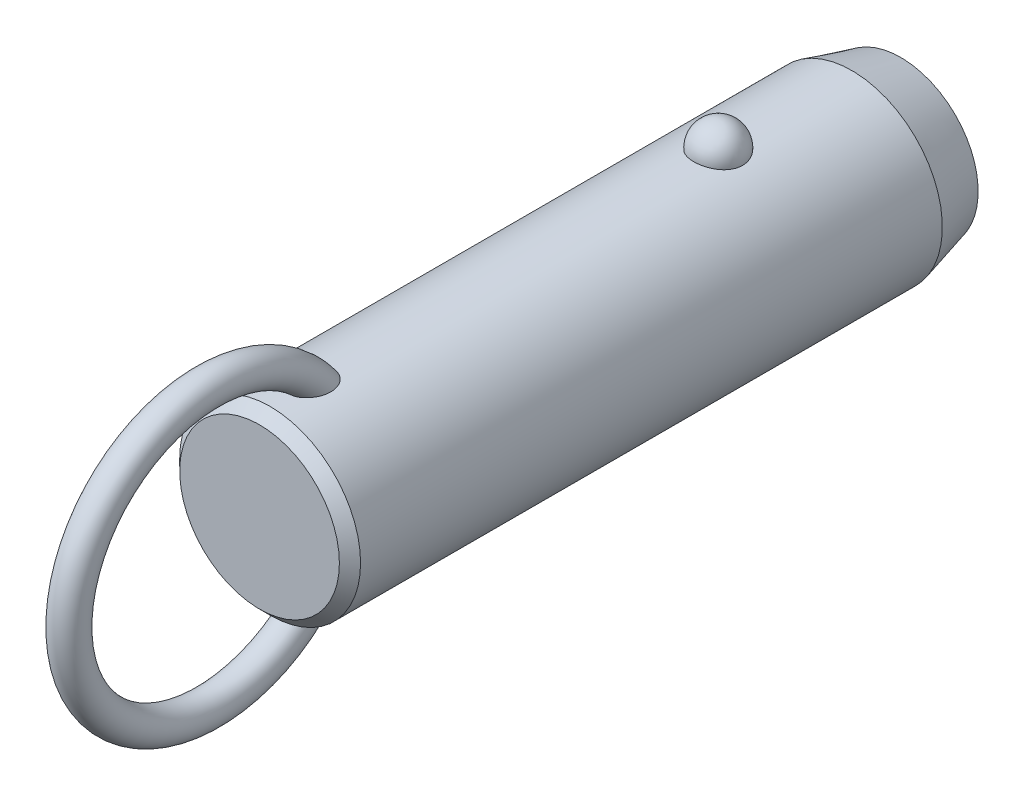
ISO-10303-21;
HEADER;
FILE_DESCRIPTION(('STEP AP214'),'2;1');
FILE_NAME('part.step','',(''),(''),'','','');
FILE_SCHEMA(('AUTOMOTIVE_DESIGN { 1 0 10303 214 1 1 1 1 }'));
ENDSEC;
DATA;
#1=APPLICATION_CONTEXT('core data for automotive mechanical design processes');
#2=APPLICATION_PROTOCOL_DEFINITION('international standard','automotive_design',2000,#1);
#3=PRODUCT_CONTEXT('',#1,'mechanical');
#4=PRODUCT('Part','Part','',(#3));
#5=PRODUCT_RELATED_PRODUCT_CATEGORY('part','',(#4));
#6=PRODUCT_DEFINITION_FORMATION('','',#4);
#7=PRODUCT_DEFINITION_CONTEXT('part definition',#1,'design');
#8=PRODUCT_DEFINITION('design','',#6,#7);
#9=PRODUCT_DEFINITION_SHAPE('','',#8);
#10=(LENGTH_UNIT() NAMED_UNIT(*) SI_UNIT(.MILLI.,.METRE.));
#11=(NAMED_UNIT(*) PLANE_ANGLE_UNIT() SI_UNIT($,.RADIAN.));
#12=(NAMED_UNIT(*) SI_UNIT($,.STERADIAN.) SOLID_ANGLE_UNIT());
#13=UNCERTAINTY_MEASURE_WITH_UNIT(LENGTH_MEASURE(1.E-05),#10,'distance_accuracy_value','');
#14=(GEOMETRIC_REPRESENTATION_CONTEXT(3) GLOBAL_UNCERTAINTY_ASSIGNED_CONTEXT((#13)) GLOBAL_UNIT_ASSIGNED_CONTEXT((#10,
#11,#12)) REPRESENTATION_CONTEXT('',''));
#15=CARTESIAN_POINT('',(0.,0.,0.));
#16=DIRECTION('',(0.,0.,1.));
#17=DIRECTION('',(1.,0.,0.));
#18=AXIS2_PLACEMENT_3D('',#15,#16,#17);
#19=CARTESIAN_POINT('',(0.,0.,40.6));
#20=DIRECTION('',(0.,0.,-1.));
#21=DIRECTION('',(-1.,0.,0.));
#22=AXIS2_PLACEMENT_3D('',#19,#20,#21);
#23=CYLINDRICAL_SURFACE('',#22,11.1);
#24=CARTESIAN_POINT('',(2.9724815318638,10.6945945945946,-3.));
#25=CARTESIAN_POINT('',(2.97247830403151,10.6945972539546,-2.83225059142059));
#26=CARTESIAN_POINT('',(2.95876598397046,10.6984356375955,-2.6644597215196));
#27=CARTESIAN_POINT('',(2.90424529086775,10.7133624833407,-2.33362381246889));
#28=CARTESIAN_POINT('',(2.8634252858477,10.7244540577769,-2.1705808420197));
#29=CARTESIAN_POINT('',(2.75573657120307,10.7526272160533,-1.85396767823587));
#30=CARTESIAN_POINT('',(2.68887937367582,10.7697061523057,-1.70039333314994));
#31=CARTESIAN_POINT('',(2.53079696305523,10.8079438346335,-1.40691598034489));
#32=CARTESIAN_POINT('',(2.43957264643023,10.8291024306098,-1.2670124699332));
#33=CARTESIAN_POINT('',(2.23458150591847,10.8732541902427,-1.00409565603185));
#34=CARTESIAN_POINT('',(2.12071295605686,10.8962553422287,-0.881162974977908));
#35=CARTESIAN_POINT('',(1.87365402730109,10.9414421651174,-0.656352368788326));
#36=CARTESIAN_POINT('',(1.74046358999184,10.9636278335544,-0.554474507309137));
#37=CARTESIAN_POINT('',(1.45872188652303,11.0046495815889,-0.374872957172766));
#38=CARTESIAN_POINT('',(1.31021276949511,11.0234944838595,-0.297085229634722));
#39=CARTESIAN_POINT('',(1.00170030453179,11.0557957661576,-0.167529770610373));
#40=CARTESIAN_POINT('',(0.841698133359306,11.0692526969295,-0.115759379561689));
#41=CARTESIAN_POINT('',(0.517607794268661,11.0890932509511,-0.0403925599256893));
#42=CARTESIAN_POINT('',(0.353633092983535,11.0955916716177,-0.0163383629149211));
#43=CARTESIAN_POINT('',(0.0238420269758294,11.1011989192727,0.00445177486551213));
#44=CARTESIAN_POINT('',(-0.141974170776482,11.1003084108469,0.0011901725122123));
#45=CARTESIAN_POINT('',(-0.468405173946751,11.0912990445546,-0.0323233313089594));
#46=CARTESIAN_POINT('',(-0.629059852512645,11.0832767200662,-0.0622147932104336));
#47=CARTESIAN_POINT('',(-0.942937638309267,11.0609962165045,-0.147645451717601));
#48=CARTESIAN_POINT('',(-1.09616062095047,11.0467379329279,-0.203185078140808));
#49=CARTESIAN_POINT('',(-1.39181061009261,11.0134071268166,-0.338752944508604));
#50=CARTESIAN_POINT('',(-1.53417383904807,10.9943086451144,-0.418913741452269));
#51=CARTESIAN_POINT('',(-1.80342160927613,10.9533667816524,-0.601448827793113));
#52=CARTESIAN_POINT('',(-1.9303046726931,10.9315231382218,-0.703825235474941));
#53=CARTESIAN_POINT('',(-2.16747598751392,10.887005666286,-0.930091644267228));
#54=CARTESIAN_POINT('',(-2.27742774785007,10.8643239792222,-1.05433291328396));
#55=CARTESIAN_POINT('',(-2.47517316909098,10.8209886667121,-1.31966633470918));
#56=CARTESIAN_POINT('',(-2.56296538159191,10.8003351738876,-1.46075958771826));
#57=CARTESIAN_POINT('',(-2.71500300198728,10.7631304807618,-1.75753646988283));
#58=CARTESIAN_POINT('',(-2.77898901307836,10.7466250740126,-1.91335887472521));
#59=CARTESIAN_POINT('',(-2.88046189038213,10.7198747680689,-2.2339152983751));
#60=CARTESIAN_POINT('',(-2.91794947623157,10.709629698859,-2.39864907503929));
#61=CARTESIAN_POINT('',(-2.96537819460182,10.6965949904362,-2.73165170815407));
#62=CARTESIAN_POINT('',(-2.97542891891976,10.693775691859,-2.89990378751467));
#63=CARTESIAN_POINT('',(-2.96804271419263,10.6958279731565,-3.23575286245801));
#64=CARTESIAN_POINT('',(-2.95060646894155,10.7006993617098,-3.40334987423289));
#65=CARTESIAN_POINT('',(-2.88883358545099,10.71753912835,-3.73233906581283));
#66=CARTESIAN_POINT('',(-2.84462026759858,10.7294749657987,-3.89375610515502));
#67=CARTESIAN_POINT('',(-2.73050447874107,10.7590797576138,-4.20667949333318));
#68=CARTESIAN_POINT('',(-2.66060103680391,10.7767489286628,-4.35818546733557));
#69=CARTESIAN_POINT('',(-2.49642559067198,10.8159599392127,-4.6478542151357));
#70=CARTESIAN_POINT('',(-2.40203047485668,10.8375211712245,-4.78594458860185));
#71=CARTESIAN_POINT('',(-2.19143488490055,10.8820570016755,-5.04410382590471));
#72=CARTESIAN_POINT('',(-2.07523364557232,10.9050316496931,-5.16417205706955));
#73=CARTESIAN_POINT('',(-1.82361254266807,10.9499219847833,-5.38334833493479));
#74=CARTESIAN_POINT('',(-1.68812945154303,10.9718338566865,-5.48238464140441));
#75=CARTESIAN_POINT('',(-1.40191298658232,11.0120611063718,-5.6561887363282));
#76=CARTESIAN_POINT('',(-1.25118062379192,11.0303767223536,-5.73095813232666));
#77=CARTESIAN_POINT('',(-0.940570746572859,11.0611653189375,-5.85334725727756));
#78=CARTESIAN_POINT('',(-0.780821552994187,11.0737044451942,-5.901275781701));
#79=CARTESIAN_POINT('',(-0.455204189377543,11.0918598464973,-5.9699297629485));
#80=CARTESIAN_POINT('',(-0.289336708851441,11.0974768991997,-5.99065827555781));
#81=CARTESIAN_POINT('',(0.0406846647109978,11.1011307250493,-6.00418773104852));
#82=CARTESIAN_POINT('',(0.204817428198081,11.099299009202,-5.99747318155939));
#83=CARTESIAN_POINT('',(0.5295530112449,11.088551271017,-5.95740317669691));
#84=CARTESIAN_POINT('',(0.69015594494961,11.0796354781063,-5.92404858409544));
#85=CARTESIAN_POINT('',(1.0027760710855,11.0557204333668,-5.83180084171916));
#86=CARTESIAN_POINT('',(1.15482001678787,11.0407414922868,-5.77299291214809));
#87=CARTESIAN_POINT('',(1.44678373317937,11.0062913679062,-5.63147366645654));
#88=CARTESIAN_POINT('',(1.58670279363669,10.9868199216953,-5.54876095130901));
#89=CARTESIAN_POINT('',(1.8527023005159,10.9451315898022,-5.36027644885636));
#90=CARTESIAN_POINT('',(1.97855158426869,10.9228788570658,-5.25418644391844));
#91=CARTESIAN_POINT('',(2.21080872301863,10.8782509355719,-5.02251354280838));
#92=CARTESIAN_POINT('',(2.31721312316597,10.8558757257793,-4.89692718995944));
#93=CARTESIAN_POINT('',(2.5094551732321,10.8130715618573,-4.62745408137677));
#94=CARTESIAN_POINT('',(2.59493284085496,10.7926798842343,-4.48330448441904));
#95=CARTESIAN_POINT('',(2.740862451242,10.7565495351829,-4.18236358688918));
#96=CARTESIAN_POINT('',(2.80132490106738,10.7408089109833,-4.02557762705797));
#97=CARTESIAN_POINT('',(2.88959070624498,10.7173718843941,-3.72475308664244));
#98=CARTESIAN_POINT('',(2.92062102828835,10.7088950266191,-3.58171216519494));
#99=CARTESIAN_POINT('',(2.96206765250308,10.6975052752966,-3.29245795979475));
#100=CARTESIAN_POINT('',(2.97248434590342,10.6945922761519,-3.14624473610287));
#101=CARTESIAN_POINT('',(2.9724815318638,10.6945945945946,-3.));
#102=B_SPLINE_CURVE_WITH_KNOTS('',3,(#24,#25,#26,#27,#28,#29,#30,#31,#32,#33,#34,#35,#36,#37,
#38,#39,#40,#41,#42,#43,#44,#45,#46,#47,#48,#49,#50,#51,#52,#53,#54,#55,#56,#57,#58,#59,#60,#61,
#62,#63,#64,#65,#66,#67,#68,#69,#70,#71,#72,#73,#74,#75,#76,#77,#78,#79,#80,#81,#82,#83,#84,#85,
#86,#87,#88,#89,#90,#91,#92,#93,#94,#95,#96,#97,#98,#99,#100,#101),.UNSPECIFIED.,.T.,.F.,(4,2,2,
2,2,2,2,2,2,2,2,2,2,2,2,2,2,2,2,2,2,2,2,2,2,2,2,2,2,2,2,2,2,2,2,2,2,2,4),(0.,0.502722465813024,
1.00566079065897,1.5083769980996,2.01107471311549,2.51608392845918,3.02109467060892,
3.52475118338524,4.02835620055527,4.523518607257,5.0186364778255,5.50715297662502,
5.9956776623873,6.48688002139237,6.97812923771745,7.47814366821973,7.9781907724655,
8.48353712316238,8.9888697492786,9.49218093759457,9.99547960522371,10.4964777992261,
10.997494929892,11.5010810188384,12.0046847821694,12.5099796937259,13.0152411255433,
13.5145635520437,14.0138298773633,14.5043200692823,14.9947943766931,15.4836390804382,
15.9725123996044,16.4685040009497,16.9645836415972,17.4686765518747,17.972557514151,
18.410841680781,18.849117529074),.UNSPECIFIED.);
#103=CARTESIAN_POINT('',(2.9724815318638,10.6945945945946,-3.));
#104=VERTEX_POINT('',#103);
#105=EDGE_CURVE('E41',#104,#104,#102,.T.);
#106=ORIENTED_EDGE('',*,*,#105,.T.);
#107=EDGE_LOOP('',(#106));
#108=FACE_BOUND('',#107,.T.);
#109=CARTESIAN_POINT('',(0.,0.,52.));
#110=DIRECTION('',(0.,0.,1.));
#111=DIRECTION('',(1.,0.,0.));
#112=AXIS2_PLACEMENT_3D('',#109,#110,#111);
#113=CIRCLE('',#112,11.1);
#114=CARTESIAN_POINT('',(11.1,0.,52.));
#115=VERTEX_POINT('',#114);
#116=EDGE_CURVE('E10',#115,#115,#113,.F.);
#117=ORIENTED_EDGE('',*,*,#116,.T.);
#118=EDGE_LOOP('',(#117));
#119=FACE_BOUND('',#118,.T.);
#120=CARTESIAN_POINT('',(-0.564520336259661,-11.0856356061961,44.2578154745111));
#121=CARTESIAN_POINT('',(-0.667202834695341,-11.0804062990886,44.2912839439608));
#122=CARTESIAN_POINT('',(-0.766875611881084,-11.0738877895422,44.3338357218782));
#123=CARTESIAN_POINT('',(-0.957284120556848,-11.0590576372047,44.4354190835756));
#124=CARTESIAN_POINT('',(-1.04801616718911,-11.0507452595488,44.4944574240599));
#125=CARTESIAN_POINT('',(-1.21800952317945,-11.0333016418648,44.6265293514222));
#126=CARTESIAN_POINT('',(-1.29730805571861,-11.0241732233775,44.6995156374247));
#127=CARTESIAN_POINT('',(-1.44337665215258,-11.0060026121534,44.8570374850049));
#128=CARTESIAN_POINT('',(-1.51014622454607,-10.9969604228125,44.9415734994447));
#129=CARTESIAN_POINT('',(-1.63454620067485,-10.9791841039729,45.1255213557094));
#130=CARTESIAN_POINT('',(-1.69127003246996,-10.9705107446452,45.2255493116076));
#131=CARTESIAN_POINT('',(-1.78980785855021,-10.9548648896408,45.4327902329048));
#132=CARTESIAN_POINT('',(-1.83161214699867,-10.9478935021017,45.5400078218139));
#133=CARTESIAN_POINT('',(-1.91557028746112,-10.9335803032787,45.8054080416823));
#134=CARTESIAN_POINT('',(-1.95040620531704,-10.9273269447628,45.9659806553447));
#135=CARTESIAN_POINT('',(-1.99388326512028,-10.9194709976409,46.2906977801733));
#136=CARTESIAN_POINT('',(-2.00248051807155,-10.9178762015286,46.4548478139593));
#137=CARTESIAN_POINT('',(-1.99551615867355,-10.9191578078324,46.8246504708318));
#138=CARTESIAN_POINT('',(-1.9732206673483,-10.9232807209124,47.0301911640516));
#139=CARTESIAN_POINT('',(-1.9152976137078,-10.9335244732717,47.333595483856));
#140=CARTESIAN_POINT('',(-1.89184575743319,-10.9376266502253,47.4340883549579));
#141=CARTESIAN_POINT('',(-1.83700674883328,-10.9469720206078,47.632855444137));
#142=CARTESIAN_POINT('',(-1.80562070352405,-10.9522150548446,47.7311299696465));
#143=CARTESIAN_POINT('',(-1.73463055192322,-10.9636837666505,47.9259148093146));
#144=CARTESIAN_POINT('',(-1.69493416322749,-10.9699202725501,48.0223907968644));
#145=CARTESIAN_POINT('',(-1.60745141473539,-10.9830806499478,48.2116262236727));
#146=CARTESIAN_POINT('',(-1.55966150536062,-10.9900048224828,48.3043840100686));
#147=CARTESIAN_POINT('',(-1.45591812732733,-11.0042280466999,48.4846907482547));
#148=CARTESIAN_POINT('',(-1.40000013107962,-11.0115253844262,48.5722601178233));
#149=CARTESIAN_POINT('',(-1.27937470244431,-11.0261911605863,48.741029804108));
#150=CARTESIAN_POINT('',(-1.21467835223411,-11.0335594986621,48.8222379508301));
#151=CARTESIAN_POINT('',(-1.08218150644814,-11.0473027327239,48.9690010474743));
#152=CARTESIAN_POINT('',(-1.01522633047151,-11.0537063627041,49.0353092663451));
#153=CARTESIAN_POINT('',(-0.872952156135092,-11.065850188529,49.1583780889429));
#154=CARTESIAN_POINT('',(-0.797642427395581,-11.0715911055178,49.2151491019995));
#155=CARTESIAN_POINT('',(-0.651396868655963,-11.081071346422,49.3075155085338));
#156=CARTESIAN_POINT('',(-0.581712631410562,-11.0849841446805,49.3450491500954));
#157=CARTESIAN_POINT('',(-0.437066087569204,-11.0916271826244,49.4082594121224));
#158=CARTESIAN_POINT('',(-0.362109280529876,-11.0943586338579,49.4339481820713));
#159=CARTESIAN_POINT('',(-0.207828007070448,-11.0983242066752,49.471117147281));
#160=CARTESIAN_POINT('',(-0.128467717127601,-11.0995432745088,49.4824545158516));
#161=CARTESIAN_POINT('',(0.0309101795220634,-11.1002423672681,49.4889658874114));
#162=CARTESIAN_POINT('',(0.110927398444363,-11.0997233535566,49.4841488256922));
#163=CARTESIAN_POINT('',(0.256406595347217,-11.097240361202,49.4609599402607));
#164=CARTESIAN_POINT('',(0.322235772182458,-11.0955074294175,49.4447543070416));
#165=CARTESIAN_POINT('',(0.450635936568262,-11.0910350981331,49.4026008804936));
#166=CARTESIAN_POINT('',(0.513205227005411,-11.0882951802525,49.3766480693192));
#167=CARTESIAN_POINT('',(0.66262634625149,-11.0805620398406,49.3026073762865));
#168=CARTESIAN_POINT('',(0.747127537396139,-11.0751144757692,49.2498452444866));
#169=CARTESIAN_POINT('',(0.906756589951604,-11.0631932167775,49.1317206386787));
#170=CARTESIAN_POINT('',(0.981859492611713,-11.0567168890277,49.0663257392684));
#171=CARTESIAN_POINT('',(1.1071220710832,-11.0447856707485,48.9422633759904));
#172=CARTESIAN_POINT('',(1.15909566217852,-11.0394280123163,48.8853831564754));
#173=CARTESIAN_POINT('',(1.25791923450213,-11.0286040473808,48.7673271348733));
#174=CARTESIAN_POINT('',(1.30476642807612,-11.0231376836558,48.7061490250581));
#175=CARTESIAN_POINT('',(1.43818612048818,-11.0068027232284,48.517305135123));
#176=CARTESIAN_POINT('',(1.51751767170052,-10.9960104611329,48.3844531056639));
#177=CARTESIAN_POINT('',(1.63597546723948,-10.9788847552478,48.1531371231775));
#178=CARTESIAN_POINT('',(1.67988876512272,-10.9722190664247,48.0570530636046));
#179=CARTESIAN_POINT('',(1.75953241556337,-10.9597298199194,47.8614311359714));
#180=CARTESIAN_POINT('',(1.79525967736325,-10.9539065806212,47.7618919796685));
#181=CARTESIAN_POINT('',(1.85844731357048,-10.9433632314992,47.5602111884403));
#182=CARTESIAN_POINT('',(1.88591073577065,-10.9386427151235,47.4580705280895));
#183=CARTESIAN_POINT('',(1.93234324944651,-10.9305350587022,47.251819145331));
#184=CARTESIAN_POINT('',(1.95131065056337,-10.9271481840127,47.1477080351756));
#185=CARTESIAN_POINT('',(1.99040203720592,-10.9201183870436,46.8654588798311));
#186=CARTESIAN_POINT('',(2.00221217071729,-10.9179256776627,46.6860370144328));
#187=CARTESIAN_POINT('',(1.99711676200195,-10.9188636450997,46.3277133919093));
#188=CARTESIAN_POINT('',(1.98026150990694,-10.9219849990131,46.1488112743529));
#189=CARTESIAN_POINT('',(1.92151657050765,-10.9324473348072,45.8364514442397));
#190=CARTESIAN_POINT('',(1.88605081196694,-10.9386915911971,45.7017594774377));
#191=CARTESIAN_POINT('',(1.79393020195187,-10.9541780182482,45.439966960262));
#192=CARTESIAN_POINT('',(1.73729868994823,-10.9634168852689,45.3128582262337));
#193=CARTESIAN_POINT('',(1.61237037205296,-10.9824218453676,45.0894184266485));
#194=CARTESIAN_POINT('',(1.54715374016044,-10.9918945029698,44.9913455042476));
#195=CARTESIAN_POINT('',(1.40127026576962,-11.0114415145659,44.8074341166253));
#196=CARTESIAN_POINT('',(1.32060742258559,-11.0215157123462,44.7215924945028));
#197=CARTESIAN_POINT('',(1.1447478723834,-11.041168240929,44.5651630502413));
#198=CARTESIAN_POINT('',(1.0494780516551,-11.0507437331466,44.4946565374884));
#199=CARTESIAN_POINT('',(0.847278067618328,-11.0680789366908,44.372640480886));
#200=CARTESIAN_POINT('',(0.740351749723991,-11.0758392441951,44.3211246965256));
#201=CARTESIAN_POINT('',(0.529289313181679,-11.0878275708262,44.2434852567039));
#202=CARTESIAN_POINT('',(0.425895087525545,-11.0923259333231,44.215377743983));
#203=CARTESIAN_POINT('',(0.215723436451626,-11.0984001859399,44.1777038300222));
#204=CARTESIAN_POINT('',(0.108947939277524,-11.0999777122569,44.1681270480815));
#205=CARTESIAN_POINT('',(-0.0938962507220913,-11.1000196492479,44.1678773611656));
#206=CARTESIAN_POINT('',(-0.189967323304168,-11.0987797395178,44.1754089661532));
#207=CARTESIAN_POINT('',(-0.379657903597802,-11.0939111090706,44.2055079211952));
#208=CARTESIAN_POINT('',(-0.473277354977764,-11.0902823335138,44.2280756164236));
#209=CARTESIAN_POINT('',(-0.564520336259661,-11.0856356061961,44.2578154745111));
#210=B_SPLINE_CURVE_WITH_KNOTS('',3,(#120,#121,#122,#123,#124,#125,#126,#127,#128,#129,#130,
#131,#132,#133,#134,#135,#136,#137,#138,#139,#140,#141,#142,#143,#144,#145,#146,#147,#148,#149,
#150,#151,#152,#153,#154,#155,#156,#157,#158,#159,#160,#161,#162,#163,#164,#165,#166,#167,#168,
#169,#170,#171,#172,#173,#174,#175,#176,#177,#178,#179,#180,#181,#182,#183,#184,#185,#186,#187,
#188,#189,#190,#191,#192,#193,#194,#195,#196,#197,#198,#199,#200,#201,#202,#203,#204,#205,#206,
#207,#208,#209),.UNSPECIFIED.,.T.,.F.,(4,2,2,2,2,2,2,2,2,2,2,2,2,2,2,2,2,2,2,2,2,2,2,2,2,2,2,2,
2,2,2,2,2,2,2,2,2,2,2,2,2,2,2,2,4),(0.,0.323999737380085,0.648132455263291,0.97118486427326,
1.29424994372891,1.63886237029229,1.98369857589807,2.47426059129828,2.96564271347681,
3.58257396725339,3.89215258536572,4.20168803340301,4.51486273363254,4.82817514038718,
5.1401591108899,5.45175282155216,5.73442856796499,6.01679375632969,6.25364580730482,
6.49025437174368,6.72919963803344,6.9680127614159,7.17061258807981,7.37331685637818,
7.67094989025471,7.96935728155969,8.20075067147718,8.43226927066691,8.89581623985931,
9.2130653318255,9.53043400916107,9.84768549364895,10.1650000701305,10.70229304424,
11.2386443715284,11.6553390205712,12.0715755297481,12.4245637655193,12.7774607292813,
13.1321855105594,13.4867936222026,13.8068771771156,14.1267813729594,14.4146787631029,
14.7025827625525),.UNSPECIFIED.);
#211=CARTESIAN_POINT('',(-0.564520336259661,-11.0856356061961,44.2578154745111));
#212=VERTEX_POINT('',#211);
#213=EDGE_CURVE('E60',#212,#212,#210,.T.);
#214=ORIENTED_EDGE('',*,*,#213,.T.);
#215=EDGE_LOOP('',(#214));
#216=FACE_BOUND('',#215,.T.);
#217=CARTESIAN_POINT('',(-0.564520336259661,11.0856356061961,44.2578154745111));
#218=CARTESIAN_POINT('',(-0.468542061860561,11.0905203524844,44.2265456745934));
#219=CARTESIAN_POINT('',(-0.369793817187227,11.0942886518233,44.2031576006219));
#220=CARTESIAN_POINT('',(-0.16955579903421,11.0991586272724,44.1730858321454));
#221=CARTESIAN_POINT('',(-0.068060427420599,11.1002543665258,44.1664393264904));
#222=CARTESIAN_POINT('',(0.134549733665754,11.099646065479,44.1701579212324));
#223=CARTESIAN_POINT('',(0.235664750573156,11.0979441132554,44.1805103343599));
#224=CARTESIAN_POINT('',(0.43463240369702,11.0919342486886,44.2178318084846));
#225=CARTESIAN_POINT('',(0.532486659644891,11.0876276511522,44.2447924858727));
#226=CARTESIAN_POINT('',(0.722445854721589,11.0768742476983,44.3144096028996));
#227=CARTESIAN_POINT('',(0.814543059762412,11.0704246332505,44.3570866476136));
#228=CARTESIAN_POINT('',(0.990565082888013,11.0560659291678,44.4566487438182));
#229=CARTESIAN_POINT('',(1.07448844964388,11.048156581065,44.5135363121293));
#230=CARTESIAN_POINT('',(1.23562672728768,11.0313221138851,44.6422106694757));
#231=CARTESIAN_POINT('',(1.31242684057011,11.0223686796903,44.7145117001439));
#232=CARTESIAN_POINT('',(1.45398030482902,11.0045918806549,44.8700425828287));
#233=CARTESIAN_POINT('',(1.51873073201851,10.9957685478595,44.9532750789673));
#234=CARTESIAN_POINT('',(1.64107232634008,10.9782087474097,45.1363842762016));
#235=CARTESIAN_POINT('',(1.6974317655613,10.9695572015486,45.2370893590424));
#236=CARTESIAN_POINT('',(1.79515063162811,10.9539887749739,45.4456264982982));
#237=CARTESIAN_POINT('',(1.83649966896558,10.9470730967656,45.5534634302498));
#238=CARTESIAN_POINT('',(1.91931148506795,10.9329211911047,45.8203995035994));
#239=CARTESIAN_POINT('',(1.95340104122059,10.9267904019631,45.9818612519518));
#240=CARTESIAN_POINT('',(1.99526195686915,10.9192174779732,46.3082163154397));
#241=CARTESIAN_POINT('',(2.00298989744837,10.9177830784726,46.4731148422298));
#242=CARTESIAN_POINT('',(1.99396251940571,10.9194420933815,46.8441006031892));
#243=CARTESIAN_POINT('',(1.97050829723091,10.923774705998,47.0500387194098));
#244=CARTESIAN_POINT('',(1.91079643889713,10.9343131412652,47.3539019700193));
#245=CARTESIAN_POINT('',(1.8867370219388,10.9385106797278,47.4545296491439));
#246=CARTESIAN_POINT('',(1.83065508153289,10.9480376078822,47.6535107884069));
#247=CARTESIAN_POINT('',(1.79863369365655,10.9533668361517,47.751864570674));
#248=CARTESIAN_POINT('',(1.72633365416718,10.9649954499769,47.9467203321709));
#249=CARTESIAN_POINT('',(1.68596409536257,10.9713053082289,48.0431879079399));
#250=CARTESIAN_POINT('',(1.59707998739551,10.9845964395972,48.2323233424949));
#251=CARTESIAN_POINT('',(1.54856169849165,10.9915780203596,48.3249894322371));
#252=CARTESIAN_POINT('',(1.44330168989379,11.0058935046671,48.5049752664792));
#253=CARTESIAN_POINT('',(1.38659749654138,11.0132257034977,48.592316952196));
#254=CARTESIAN_POINT('',(1.26431158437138,11.0279330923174,48.7604563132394));
#255=CARTESIAN_POINT('',(1.19874160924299,11.0353082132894,48.8412624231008));
#256=CARTESIAN_POINT('',(1.06542088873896,11.048931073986,48.9859856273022));
#257=CARTESIAN_POINT('',(0.998640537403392,11.0552153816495,49.050784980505));
#258=CARTESIAN_POINT('',(0.856896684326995,11.0671032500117,49.1708462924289));
#259=CARTESIAN_POINT('',(0.781942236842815,11.0727075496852,49.2261186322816));
#260=CARTESIAN_POINT('',(0.636276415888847,11.081949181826,49.3159721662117));
#261=CARTESIAN_POINT('',(0.566755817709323,11.0857572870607,49.3524410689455));
#262=CARTESIAN_POINT('',(0.422602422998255,11.0921860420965,49.4135333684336));
#263=CARTESIAN_POINT('',(0.347974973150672,11.0948079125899,49.4381689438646));
#264=CARTESIAN_POINT('',(0.194593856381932,11.0985608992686,49.4733233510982));
#265=CARTESIAN_POINT('',(0.115807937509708,11.0996777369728,49.4837069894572));
#266=CARTESIAN_POINT('',(-0.0422499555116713,11.1002003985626,49.4885747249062));
#267=CARTESIAN_POINT('',(-0.121521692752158,11.09960699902,49.483066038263));
#268=CARTESIAN_POINT('',(-0.266046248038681,11.0970123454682,49.4588271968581));
#269=CARTESIAN_POINT('',(-0.331661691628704,11.0952283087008,49.4421356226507));
#270=CARTESIAN_POINT('',(-0.459588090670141,11.0906663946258,49.3991117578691));
#271=CARTESIAN_POINT('',(-0.521897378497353,11.0878880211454,49.372774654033));
#272=CARTESIAN_POINT('',(-0.671446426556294,11.0800342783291,49.2975130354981));
#273=CARTESIAN_POINT('',(-0.75625045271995,11.0744969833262,49.2438182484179));
#274=CARTESIAN_POINT('',(-0.91634957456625,11.0624045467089,49.1238029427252));
#275=CARTESIAN_POINT('',(-0.991618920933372,11.0558467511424,49.0574493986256));
#276=CARTESIAN_POINT('',(-1.11713140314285,11.0437783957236,48.9316335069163));
#277=CARTESIAN_POINT('',(-1.16920539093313,11.0383619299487,48.8739524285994));
#278=CARTESIAN_POINT('',(-1.26817476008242,11.02743010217,48.7542809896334));
#279=CARTESIAN_POINT('',(-1.315067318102,11.0219146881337,48.6922883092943));
#280=CARTESIAN_POINT('',(-1.40399813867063,11.0109399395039,48.5647843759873));
#281=CARTESIAN_POINT('',(-1.4460286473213,11.0054807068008,48.4992677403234));
#282=CARTESIAN_POINT('',(-1.52538779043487,10.9947621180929,48.3654223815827));
#283=CARTESIAN_POINT('',(-1.56271516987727,10.9895028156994,48.2970929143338));
#284=CARTESIAN_POINT('',(-1.64537943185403,10.9774790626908,48.1332101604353));
#285=CARTESIAN_POINT('',(-1.68879497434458,10.9708503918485,48.0366735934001));
#286=CARTESIAN_POINT('',(-1.76740738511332,10.9584602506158,47.8402369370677));
#287=CARTESIAN_POINT('',(-1.80260120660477,10.95269910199,47.7403356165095));
#288=CARTESIAN_POINT('',(-1.86468657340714,10.9423003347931,47.5379663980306));
#289=CARTESIAN_POINT('',(-1.8915816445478,10.9376622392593,47.4354996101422));
#290=CARTESIAN_POINT('',(-1.93682458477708,10.9297405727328,47.2286429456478));
#291=CARTESIAN_POINT('',(-1.95517082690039,10.9264572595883,47.1242527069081));
#292=CARTESIAN_POINT('',(-1.99232562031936,10.9197647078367,46.8426287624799));
#293=CARTESIAN_POINT('',(-2.00294603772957,10.9177914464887,46.6641857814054));
#294=CARTESIAN_POINT('',(-1.99566675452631,10.9191290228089,46.3079962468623));
#295=CARTESIAN_POINT('',(-1.97781651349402,10.9224306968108,46.1302490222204));
#296=CARTESIAN_POINT('',(-1.91747214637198,10.93315926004,45.8197921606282));
#297=CARTESIAN_POINT('',(-1.88131022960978,10.9395108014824,45.685825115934));
#298=CARTESIAN_POINT('',(-1.78790380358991,10.9551659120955,45.4255975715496));
#299=CARTESIAN_POINT('',(-1.7306830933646,10.9644661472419,45.2993285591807));
#300=CARTESIAN_POINT('',(-1.60475573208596,10.9835398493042,45.0774156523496));
#301=CARTESIAN_POINT('',(-1.53908879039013,10.9930297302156,44.9800265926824));
#302=CARTESIAN_POINT('',(-1.39238608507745,11.0125708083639,44.7975250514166));
#303=CARTESIAN_POINT('',(-1.31135150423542,11.0226219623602,44.7124116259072));
#304=CARTESIAN_POINT('',(-1.14382035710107,11.0411991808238,44.5652994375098));
#305=CARTESIAN_POINT('',(-1.05858500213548,11.0497792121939,44.5018693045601));
#306=CARTESIAN_POINT('',(-0.878723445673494,11.0655285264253,44.3902505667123));
#307=CARTESIAN_POINT('',(-0.78412346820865,11.0727015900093,44.3420208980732));
#308=CARTESIAN_POINT('',(-0.646163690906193,11.0812501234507,44.286023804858));
#309=CARTESIAN_POINT('',(-0.605595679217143,11.0835451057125,44.2711978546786));
#310=CARTESIAN_POINT('',(-0.564520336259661,11.0856356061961,44.2578154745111));
#311=B_SPLINE_CURVE_WITH_KNOTS('',3,(#217,#218,#219,#220,#221,#222,#223,#224,#225,#226,#227,
#228,#229,#230,#231,#232,#233,#234,#235,#236,#237,#238,#239,#240,#241,#242,#243,#244,#245,#246,
#247,#248,#249,#250,#251,#252,#253,#254,#255,#256,#257,#258,#259,#260,#261,#262,#263,#264,#265,
#266,#267,#268,#269,#270,#271,#272,#273,#274,#275,#276,#277,#278,#279,#280,#281,#282,#283,#284,
#285,#286,#287,#288,#289,#290,#291,#292,#293,#294,#295,#296,#297,#298,#299,#300,#301,#302,#303,
#304,#305,#306,#307,#308,#309,#310),.UNSPECIFIED.,.T.,.F.,(4,2,2,2,2,2,2,2,2,2,2,2,2,2,2,2,2,2,
2,2,2,2,2,2,2,2,2,2,2,2,2,2,2,2,2,2,2,2,2,2,2,2,2,2,2,2,4),(0.,0.303061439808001,
0.60679549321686,0.910302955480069,1.21365733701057,1.51741085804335,1.82121821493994,
2.13745205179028,2.45376252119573,2.79958678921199,3.14564996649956,3.6383239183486,
4.13180893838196,4.75031912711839,5.06071926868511,5.37107516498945,5.68500772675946,
5.99908475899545,6.31176519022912,6.62403542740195,6.90315673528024,7.18197194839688,
7.41687778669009,7.6515413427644,7.88841587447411,8.12518286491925,8.32752842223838,
8.5299750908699,8.82986421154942,9.13054668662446,9.36393502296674,9.59744991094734,
9.83133221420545,10.0652767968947,10.383032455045,10.7009056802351,11.0186436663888,
11.3364420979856,11.8705925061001,12.4038159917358,12.8189662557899,13.2336487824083,
13.5857049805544,13.9377340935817,14.2561354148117,14.5736690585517,14.7033687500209),.UNSPECIFIED.);
#312=CARTESIAN_POINT('',(-0.564520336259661,11.0856356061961,44.2578154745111));
#313=VERTEX_POINT('',#312);
#314=EDGE_CURVE('E68',#313,#313,#311,.T.);
#315=ORIENTED_EDGE('',*,*,#314,.T.);
#316=EDGE_LOOP('',(#315));
#317=FACE_BOUND('',#316,.T.);
#318=CARTESIAN_POINT('',(0.,0.,-19.3999999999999));
#319=DIRECTION('',(0.,0.,-1.));
#320=DIRECTION('',(-1.,0.,0.));
#321=AXIS2_PLACEMENT_3D('',#318,#319,#320);
#322=CIRCLE('',#321,11.1);
#323=CARTESIAN_POINT('',(-11.1,0.,-19.3999999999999));
#324=VERTEX_POINT('',#323);
#325=EDGE_CURVE('E57',#324,#324,#322,.F.);
#326=ORIENTED_EDGE('',*,*,#325,.T.);
#327=EDGE_LOOP('',(#326));
#328=FACE_BOUND('',#327,.T.);
#329=ADVANCED_FACE('F37',(#108,#119,#216,#317,#328),#23,.T.);
#330=CARTESIAN_POINT('',(0.,0.,-25.4));
#331=DIRECTION('',(0.,0.,-1.));
#332=DIRECTION('',(-1.,0.,0.));
#333=AXIS2_PLACEMENT_3D('',#330,#331,#332);
#334=PLANE('',#333);
#335=CARTESIAN_POINT('',(0.,0.,-25.4));
#336=DIRECTION('',(0.,0.,-1.));
#337=DIRECTION('',(-1.,0.,0.));
#338=AXIS2_PLACEMENT_3D('',#335,#336,#337);
#339=CIRCLE('',#338,9.49230484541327);
#340=CARTESIAN_POINT('',(-9.49230484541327,0.,-25.4));
#341=VERTEX_POINT('',#340);
#342=EDGE_CURVE('E67',#341,#341,#339,.T.);
#343=ORIENTED_EDGE('',*,*,#342,.T.);
#344=EDGE_LOOP('',(#343));
#345=FACE_BOUND('',#344,.T.);
#346=ADVANCED_FACE('F86',(#345),#334,.T.);
#347=CARTESIAN_POINT('',(0.,0.,-25.4));
#348=DIRECTION('',(0.,0.,1.));
#349=DIRECTION('',(1.,0.,0.));
#350=AXIS2_PLACEMENT_3D('',#347,#348,#349);
#351=CONICAL_SURFACE('',#350,9.49230484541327,0.261799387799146);
#352=ORIENTED_EDGE('',*,*,#325,.F.);
#353=EDGE_LOOP('',(#352));
#354=FACE_BOUND('',#353,.T.);
#355=ORIENTED_EDGE('',*,*,#342,.F.);
#356=EDGE_LOOP('',(#355));
#357=FACE_BOUND('',#356,.T.);
#358=ADVANCED_FACE('F84',(#354,#357),#351,.T.);
#359=CARTESIAN_POINT('',(0.,0.,53.3));
#360=DIRECTION('',(0.,0.,1.));
#361=DIRECTION('',(1.,0.,0.));
#362=AXIS2_PLACEMENT_3D('',#359,#360,#361);
#363=PLANE('',#362);
#364=CARTESIAN_POINT('',(0.,0.,53.3));
#365=DIRECTION('',(0.,0.,1.));
#366=DIRECTION('',(1.,0.,0.));
#367=AXIS2_PLACEMENT_3D('',#364,#365,#366);
#368=CIRCLE('',#367,9.80000000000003);
#369=CARTESIAN_POINT('',(9.80000000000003,0.,53.3));
#370=VERTEX_POINT('',#369);
#371=EDGE_CURVE('E50',#370,#370,#368,.T.);
#372=ORIENTED_EDGE('',*,*,#371,.T.);
#373=EDGE_LOOP('',(#372));
#374=FACE_BOUND('',#373,.T.);
#375=ADVANCED_FACE('F78',(#374),#363,.T.);
#376=CARTESIAN_POINT('',(0.,0.,59.65));
#377=DIRECTION('',(1.,0.,0.));
#378=DIRECTION('',(0.,0.,-1.));
#379=AXIS2_PLACEMENT_3D('',#376,#377,#378);
#380=TOROIDAL_SURFACE('',#379,17.05,2.);
#381=ORIENTED_EDGE('',*,*,#314,.F.);
#382=EDGE_LOOP('',(#381));
#383=FACE_BOUND('',#382,.T.);
#384=ORIENTED_EDGE('',*,*,#213,.F.);
#385=EDGE_LOOP('',(#384));
#386=FACE_BOUND('',#385,.T.);
#387=ADVANCED_FACE('F74',(#383,#386),#380,.T.);
#388=CARTESIAN_POINT('',(0.,0.,53.3));
#389=DIRECTION('',(0.,0.,-1.));
#390=DIRECTION('',(-1.,0.,0.));
#391=AXIS2_PLACEMENT_3D('',#388,#389,#390);
#392=CONICAL_SURFACE('',#391,9.80000000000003,0.785398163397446);
#393=ORIENTED_EDGE('',*,*,#116,.F.);
#394=EDGE_LOOP('',(#393));
#395=FACE_BOUND('',#394,.T.);
#396=ORIENTED_EDGE('',*,*,#371,.F.);
#397=EDGE_LOOP('',(#396));
#398=FACE_BOUND('',#397,.T.);
#399=ADVANCED_FACE('F39',(#395,#398),#392,.T.);
#400=CARTESIAN_POINT('',(0.,11.1,-3.));
#401=DIRECTION('',(0.,1.,0.));
#402=DIRECTION('',(0.,0.,-1.));
#403=AXIS2_PLACEMENT_3D('',#400,#401,#402);
#404=SPHERICAL_SURFACE('',#403,3.);
#405=ORIENTED_EDGE('',*,*,#105,.F.);
#406=EDGE_LOOP('',(#405));
#407=FACE_BOUND('',#406,.T.);
#408=ADVANCED_FACE('F80',(#407),#404,.T.);
#409=CLOSED_SHELL('',(#329,#346,#358,#375,#387,#399,#408));
#410=MANIFOLD_SOLID_BREP('B2',#409);
#411=ADVANCED_BREP_SHAPE_REPRESENTATION('',(#18,#410),#14);
#412=SHAPE_DEFINITION_REPRESENTATION(#9,#411);
ENDSEC;
END-ISO-10303-21;
